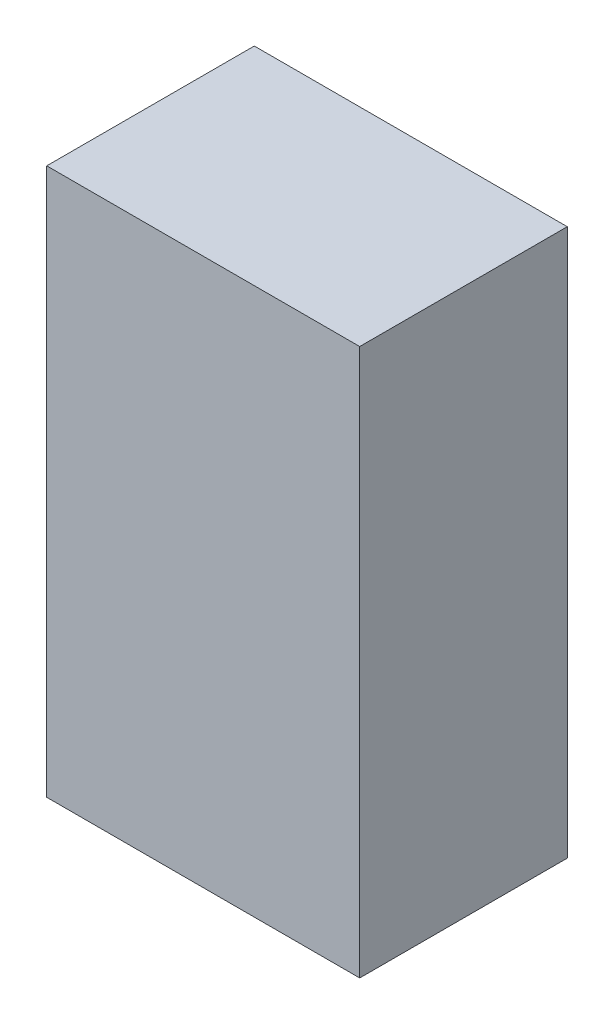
from build123d import *

# Parameters (mm, degrees)
ESQUISSE1_W      = 95
ESQUISSE1_H      = 63
EXTRUSION1_DEPTH = 166


with BuildPart() as part:
    # Esquisse1 → Extrusion1 (new body)
    with BuildSketch(Plane(origin=(0, 0, 0), x_dir=(1, 0, 0), z_dir=(0, 1, 0))):
        Rectangle(ESQUISSE1_W, ESQUISSE1_H)
    extrude(amount=EXTRUSION1_DEPTH)


solid = part.part
